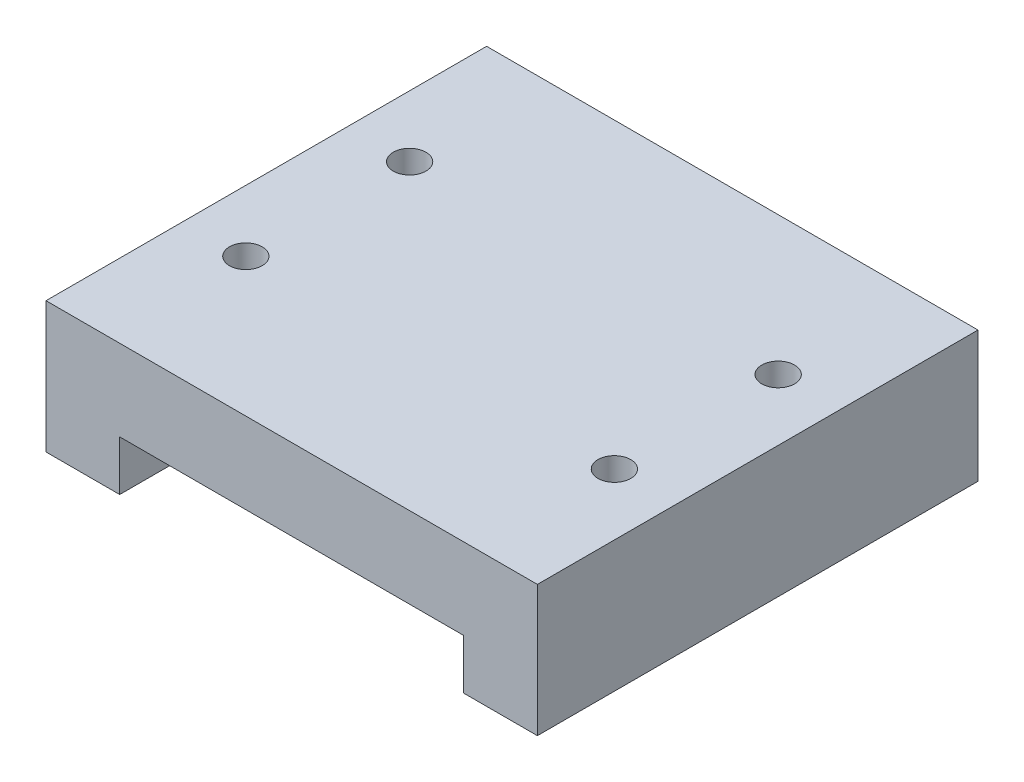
from build123d import *

# Parameters (mm, degrees)
EXTRUDE_1_DEPTH     = 53.8
SKETCH_2_R          = 2
CUT_EXTRUDE_1_DEPTH = 4.2


with BuildPart() as part:
    # Sketch 1 → Extrude 1 (new body)
    with BuildSketch(Plane.XY):
        Polygon((30, 8), (-30, 8), (-30, -8), (-21, -8), (-21, -1.9), (21, -1.9), (21, -8), (30, -8), align=None)
    extrude(amount=EXTRUDE_1_DEPTH)

    # Sketch 2 → Cut-Extrude 1 (cut)
    with BuildSketch(Plane(origin=(0, 8, 0), x_dir=(1, 0, 0), z_dir=(0, 1, 0))):
        with Locations(Location((-22.5, -16.9, 0), (0, 0, 270))):
            Circle(SKETCH_2_R)
        with Locations(Location((-22.5, -36.9, 0), (0, 0, 90))):
            Circle(SKETCH_2_R)
        with Locations(Location((22.5, -36.9, 0), (0, 0, 270))):
            Circle(SKETCH_2_R)
        with Locations(Location((22.5, -16.9, 0), (0, 0, 90))):
            Circle(SKETCH_2_R)
    extrude(amount=-CUT_EXTRUDE_1_DEPTH, mode=Mode.SUBTRACT)


solid = part.part
